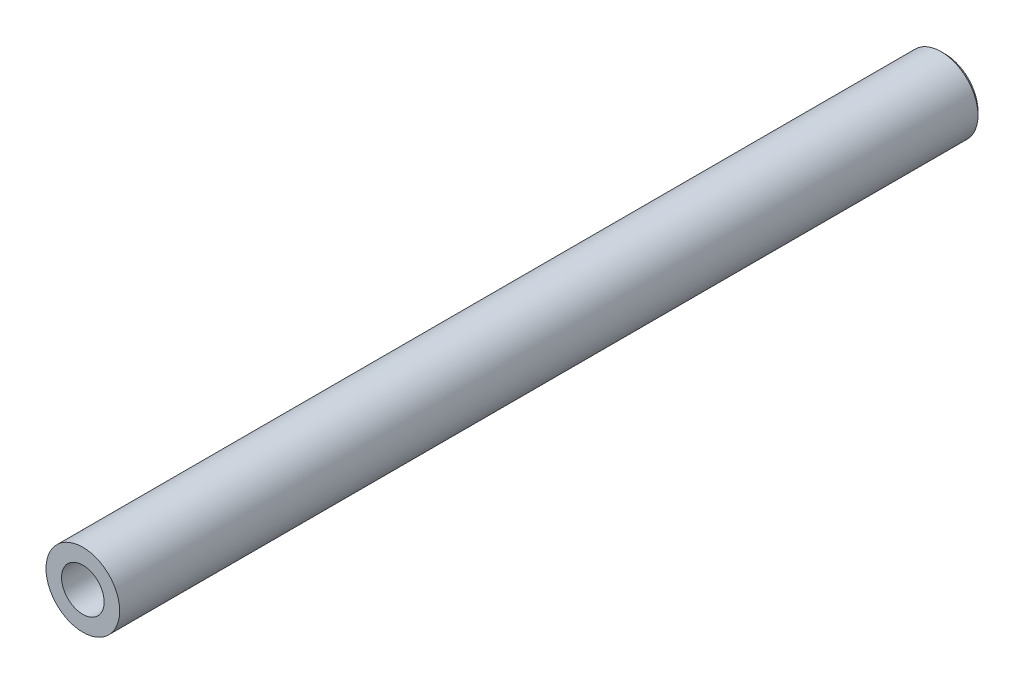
from build123d import *

# Parameters (mm, degrees)
SKETCH6_R                          = 2.9845
EXTRUDE2_DEPTH                     = 69.85
CHAMFER1_SIZE                      = 0.29845
F_3_16_0_1875_DIAMETER_HOLE1_D     = 4.7625
F_3_16_0_1875_DIAMETER_HOLE1_DEPTH = 6.35
F_3_16_0_1875_DIAMETER_HOLE1_TIP   = 1.430799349
F_8_32_TAPPED_HOLE1_D              = 3.4544
F_8_32_TAPPED_HOLE1_DEPTH          = 16.51
F_8_32_TAPPED_HOLE1_TIP            = 1.037806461


with BuildPart() as part:
    # Sketch6 → Extrude2 (new body)
    with BuildSketch(Plane(origin=(0, 0, 0), x_dir=(-1, 0, 0), z_dir=(0, 0, -1))):
        Circle(SKETCH6_R)
    extrude(amount=EXTRUDE2_DEPTH)

    # Chamfer1
    chamfer1_edges = [part.edges().sort_by_distance(p)[0] for p in [
        (2.9845, 0, -69.85),
    ]]
    chamfer(chamfer1_edges, length=CHAMFER1_SIZE)

    # 3_16 _0.1875_ Diameter Hole1
    with Locations(Plane(origin=(0, 0, -69.85), x_dir=(-1, 0, 0), z_dir=(0, 0, -1))):
        with Locations((0, 0)):
            Hole(F_3_16_0_1875_DIAMETER_HOLE1_D / 2, depth=F_3_16_0_1875_DIAMETER_HOLE1_DEPTH)
            with Locations((0, 0, -(F_3_16_0_1875_DIAMETER_HOLE1_DEPTH + F_3_16_0_1875_DIAMETER_HOLE1_TIP / 2))):  # 118° drill point
                Cone(0, F_3_16_0_1875_DIAMETER_HOLE1_D / 2, F_3_16_0_1875_DIAMETER_HOLE1_TIP, mode=Mode.SUBTRACT)

    # 8-32 Tapped Hole1
    with Locations(Plane.XY):
        with Locations((0, 0)):
            Hole(F_8_32_TAPPED_HOLE1_D / 2, depth=F_8_32_TAPPED_HOLE1_DEPTH)
            with Locations((0, 0, -(F_8_32_TAPPED_HOLE1_DEPTH + F_8_32_TAPPED_HOLE1_TIP / 2))):  # 118° drill point
                Cone(0, F_8_32_TAPPED_HOLE1_D / 2, F_8_32_TAPPED_HOLE1_TIP, mode=Mode.SUBTRACT)


solid = part.part
